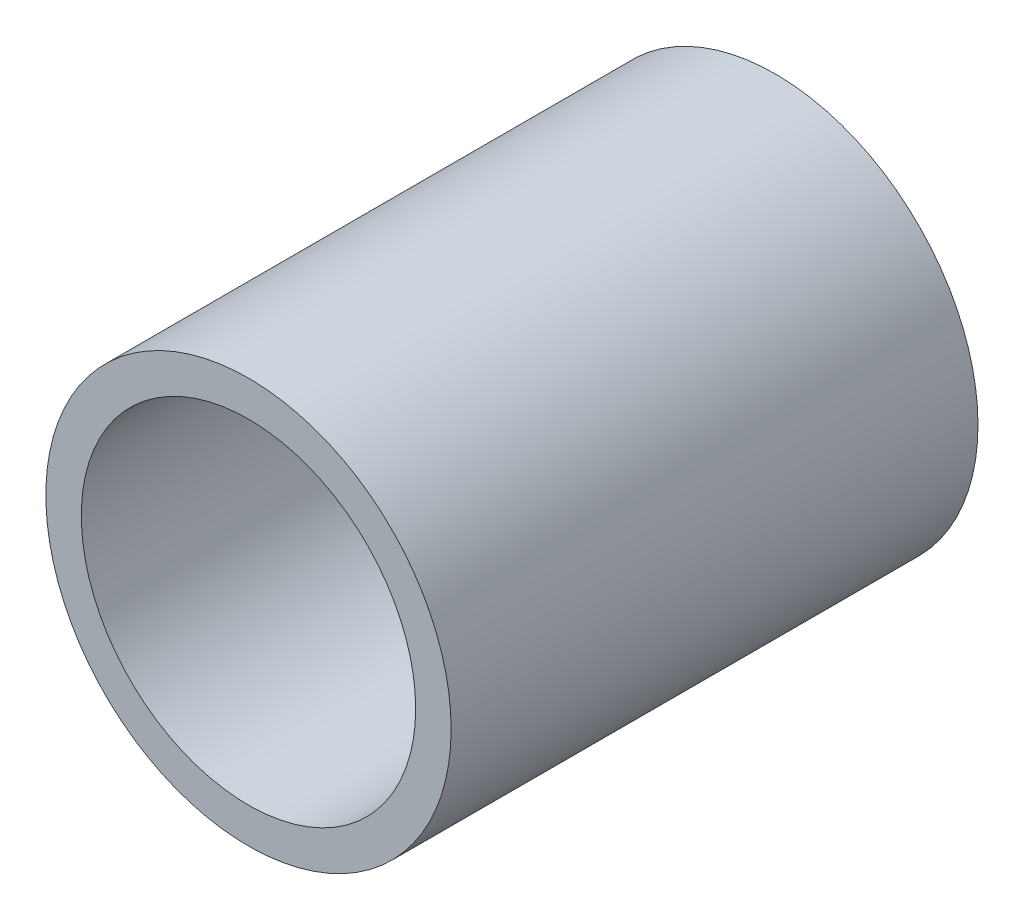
ISO-10303-21;
HEADER;
FILE_DESCRIPTION(('STEP AP214'),'2;1');
FILE_NAME('part.step','',(''),(''),'','','');
FILE_SCHEMA(('AUTOMOTIVE_DESIGN { 1 0 10303 214 1 1 1 1 }'));
ENDSEC;
DATA;
#1=APPLICATION_CONTEXT('core data for automotive mechanical design processes');
#2=APPLICATION_PROTOCOL_DEFINITION('international standard','automotive_design',2000,#1);
#3=PRODUCT_CONTEXT('',#1,'mechanical');
#4=PRODUCT('Part','Part','',(#3));
#5=PRODUCT_RELATED_PRODUCT_CATEGORY('part','',(#4));
#6=PRODUCT_DEFINITION_FORMATION('','',#4);
#7=PRODUCT_DEFINITION_CONTEXT('part definition',#1,'design');
#8=PRODUCT_DEFINITION('design','',#6,#7);
#9=PRODUCT_DEFINITION_SHAPE('','',#8);
#10=(LENGTH_UNIT() NAMED_UNIT(*) SI_UNIT(.MILLI.,.METRE.));
#11=(NAMED_UNIT(*) PLANE_ANGLE_UNIT() SI_UNIT($,.RADIAN.));
#12=(NAMED_UNIT(*) SI_UNIT($,.STERADIAN.) SOLID_ANGLE_UNIT());
#13=UNCERTAINTY_MEASURE_WITH_UNIT(LENGTH_MEASURE(1.E-05),#10,'distance_accuracy_value','');
#14=(GEOMETRIC_REPRESENTATION_CONTEXT(3) GLOBAL_UNCERTAINTY_ASSIGNED_CONTEXT((#13)) GLOBAL_UNIT_ASSIGNED_CONTEXT((#10,
#11,#12)) REPRESENTATION_CONTEXT('',''));
#15=CARTESIAN_POINT('',(0.,0.,0.));
#16=DIRECTION('',(0.,0.,1.));
#17=DIRECTION('',(1.,0.,0.));
#18=AXIS2_PLACEMENT_3D('',#15,#16,#17);
#19=CARTESIAN_POINT('',(0.,0.,10.4));
#20=DIRECTION('',(0.,0.,1.));
#21=DIRECTION('',(1.,0.,0.));
#22=AXIS2_PLACEMENT_3D('',#19,#20,#21);
#23=PLANE('',#22);
#24=CARTESIAN_POINT('',(0.,0.,10.4));
#25=DIRECTION('',(0.,0.,1.));
#26=DIRECTION('',(1.,0.,0.));
#27=AXIS2_PLACEMENT_3D('',#24,#25,#26);
#28=CIRCLE('',#27,4.);
#29=CARTESIAN_POINT('',(4.,0.,10.4));
#30=VERTEX_POINT('',#29);
#31=EDGE_CURVE('E10',#30,#30,#28,.T.);
#32=ORIENTED_EDGE('',*,*,#31,.T.);
#33=EDGE_LOOP('',(#32));
#34=FACE_BOUND('',#33,.T.);
#35=CARTESIAN_POINT('',(0.,0.,10.4));
#36=DIRECTION('',(0.,0.,1.));
#37=DIRECTION('',(1.,0.,0.));
#38=AXIS2_PLACEMENT_3D('',#35,#36,#37);
#39=CIRCLE('',#38,3.3);
#40=CARTESIAN_POINT('',(3.3,0.,10.4));
#41=VERTEX_POINT('',#40);
#42=EDGE_CURVE('E40',#41,#41,#39,.T.);
#43=ORIENTED_EDGE('',*,*,#42,.F.);
#44=EDGE_LOOP('',(#43));
#45=FACE_BOUND('',#44,.T.);
#46=ADVANCED_FACE('F29',(#34,#45),#23,.T.);
#47=CARTESIAN_POINT('',(0.,0.,0.));
#48=DIRECTION('',(0.,0.,1.));
#49=DIRECTION('',(1.,0.,0.));
#50=AXIS2_PLACEMENT_3D('',#47,#48,#49);
#51=PLANE('',#50);
#52=CARTESIAN_POINT('',(0.,0.,0.));
#53=DIRECTION('',(0.,0.,1.));
#54=DIRECTION('',(1.,0.,0.));
#55=AXIS2_PLACEMENT_3D('',#52,#53,#54);
#56=CIRCLE('',#55,4.);
#57=CARTESIAN_POINT('',(4.,0.,0.));
#58=VERTEX_POINT('',#57);
#59=EDGE_CURVE('E36',#58,#58,#56,.T.);
#60=ORIENTED_EDGE('',*,*,#59,.F.);
#61=EDGE_LOOP('',(#60));
#62=FACE_BOUND('',#61,.T.);
#63=CARTESIAN_POINT('',(0.,0.,0.));
#64=DIRECTION('',(0.,0.,1.));
#65=DIRECTION('',(1.,0.,0.));
#66=AXIS2_PLACEMENT_3D('',#63,#64,#65);
#67=CIRCLE('',#66,3.3);
#68=CARTESIAN_POINT('',(3.3,0.,0.));
#69=VERTEX_POINT('',#68);
#70=EDGE_CURVE('E44',#69,#69,#67,.T.);
#71=ORIENTED_EDGE('',*,*,#70,.T.);
#72=EDGE_LOOP('',(#71));
#73=FACE_BOUND('',#72,.T.);
#74=ADVANCED_FACE('F50',(#62,#73),#51,.F.);
#75=CARTESIAN_POINT('',(0.,0.,10.4));
#76=DIRECTION('',(0.,0.,-1.));
#77=DIRECTION('',(-1.,0.,0.));
#78=AXIS2_PLACEMENT_3D('',#75,#76,#77);
#79=CYLINDRICAL_SURFACE('',#78,4.);
#80=ORIENTED_EDGE('',*,*,#31,.F.);
#81=EDGE_LOOP('',(#80));
#82=FACE_BOUND('',#81,.T.);
#83=ORIENTED_EDGE('',*,*,#59,.T.);
#84=EDGE_LOOP('',(#83));
#85=FACE_BOUND('',#84,.T.);
#86=ADVANCED_FACE('F31',(#82,#85),#79,.T.);
#87=CARTESIAN_POINT('',(0.,0.,10.4));
#88=DIRECTION('',(0.,0.,-1.));
#89=DIRECTION('',(-1.,0.,0.));
#90=AXIS2_PLACEMENT_3D('',#87,#88,#89);
#91=CYLINDRICAL_SURFACE('',#90,3.3);
#92=ORIENTED_EDGE('',*,*,#42,.T.);
#93=EDGE_LOOP('',(#92));
#94=FACE_BOUND('',#93,.T.);
#95=ORIENTED_EDGE('',*,*,#70,.F.);
#96=EDGE_LOOP('',(#95));
#97=FACE_BOUND('',#96,.T.);
#98=ADVANCED_FACE('F52',(#94,#97),#91,.F.);
#99=CLOSED_SHELL('',(#46,#74,#86,#98));
#100=MANIFOLD_SOLID_BREP('B2',#99);
#101=ADVANCED_BREP_SHAPE_REPRESENTATION('',(#18,#100),#14);
#102=SHAPE_DEFINITION_REPRESENTATION(#9,#101);
ENDSEC;
END-ISO-10303-21;
